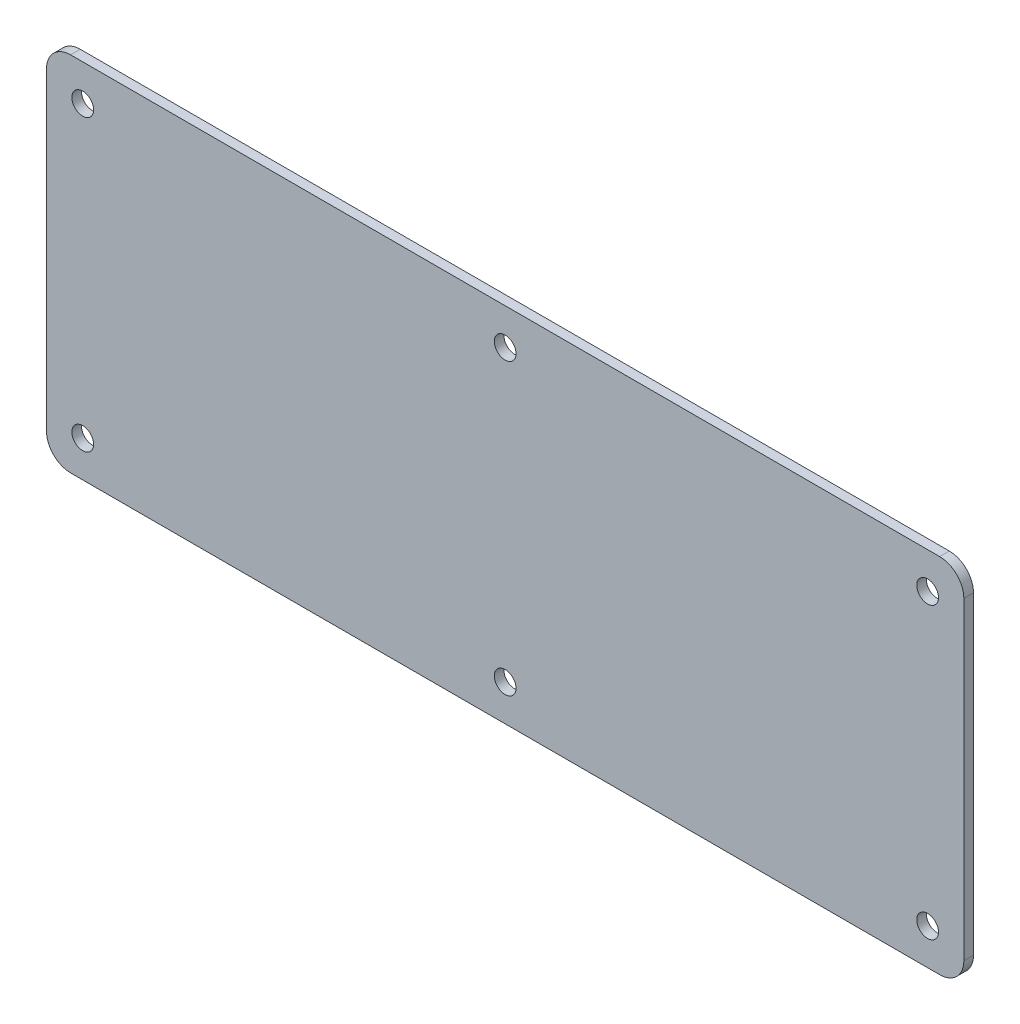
ISO-10303-21;
HEADER;
FILE_DESCRIPTION(('STEP AP214'),'2;1');
FILE_NAME('part.step','',(''),(''),'','','');
FILE_SCHEMA(('AUTOMOTIVE_DESIGN { 1 0 10303 214 1 1 1 1 }'));
ENDSEC;
DATA;
#1=APPLICATION_CONTEXT('core data for automotive mechanical design processes');
#2=APPLICATION_PROTOCOL_DEFINITION('international standard','automotive_design',2000,#1);
#3=PRODUCT_CONTEXT('',#1,'mechanical');
#4=PRODUCT('Part','Part','',(#3));
#5=PRODUCT_RELATED_PRODUCT_CATEGORY('part','',(#4));
#6=PRODUCT_DEFINITION_FORMATION('','',#4);
#7=PRODUCT_DEFINITION_CONTEXT('part definition',#1,'design');
#8=PRODUCT_DEFINITION('design','',#6,#7);
#9=PRODUCT_DEFINITION_SHAPE('','',#8);
#10=(LENGTH_UNIT() NAMED_UNIT(*) SI_UNIT(.MILLI.,.METRE.));
#11=(NAMED_UNIT(*) PLANE_ANGLE_UNIT() SI_UNIT($,.RADIAN.));
#12=(NAMED_UNIT(*) SI_UNIT($,.STERADIAN.) SOLID_ANGLE_UNIT());
#13=UNCERTAINTY_MEASURE_WITH_UNIT(LENGTH_MEASURE(1.E-05),#10,'distance_accuracy_value','');
#14=(GEOMETRIC_REPRESENTATION_CONTEXT(3) GLOBAL_UNCERTAINTY_ASSIGNED_CONTEXT((#13)) GLOBAL_UNIT_ASSIGNED_CONTEXT((#10,
#11,#12)) REPRESENTATION_CONTEXT('',''));
#15=CARTESIAN_POINT('',(0.,0.,0.));
#16=DIRECTION('',(0.,0.,1.));
#17=DIRECTION('',(1.,0.,0.));
#18=AXIS2_PLACEMENT_3D('',#15,#16,#17);
#19=CARTESIAN_POINT('',(359.966843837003,45.2847380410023,4.));
#20=DIRECTION('',(0.,0.,-1.));
#21=DIRECTION('',(-1.,0.,0.));
#22=AXIS2_PLACEMENT_3D('',#19,#20,#21);
#23=PLANE('',#22);
#24=CARTESIAN_POINT('',(179.966843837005,-79.7152619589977,4.));
#25=DIRECTION('',(0.,0.,1.));
#26=DIRECTION('',(1.,0.,0.));
#27=AXIS2_PLACEMENT_3D('',#24,#25,#26);
#28=CIRCLE('',#27,4.49999999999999);
#29=CARTESIAN_POINT('',(184.466843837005,-79.7152619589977,4.));
#30=VERTEX_POINT('',#29);
#31=EDGE_CURVE('E241',#30,#30,#28,.T.);
#32=ORIENTED_EDGE('',*,*,#31,.F.);
#33=EDGE_LOOP('',(#32));
#34=FACE_BOUND('',#33,.T.);
#35=CARTESIAN_POINT('',(354.966843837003,40.2847380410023,4.));
#36=DIRECTION('',(0.,0.,1.));
#37=DIRECTION('',(1.,0.,0.));
#38=AXIS2_PLACEMENT_3D('',#35,#36,#37);
#39=CIRCLE('',#38,4.50000000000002);
#40=CARTESIAN_POINT('',(359.466843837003,40.2847380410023,4.));
#41=VERTEX_POINT('',#40);
#42=EDGE_CURVE('E253',#41,#41,#39,.T.);
#43=ORIENTED_EDGE('',*,*,#42,.F.);
#44=EDGE_LOOP('',(#43));
#45=FACE_BOUND('',#44,.T.);
#46=CARTESIAN_POINT('',(4.96684383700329,40.2847380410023,4.));
#47=DIRECTION('',(0.,0.,1.));
#48=DIRECTION('',(1.,0.,0.));
#49=AXIS2_PLACEMENT_3D('',#46,#47,#48);
#50=CIRCLE('',#49,4.50000000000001);
#51=CARTESIAN_POINT('',(9.46684383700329,40.2847380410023,4.));
#52=VERTEX_POINT('',#51);
#53=EDGE_CURVE('E115',#52,#52,#50,.T.);
#54=ORIENTED_EDGE('',*,*,#53,.F.);
#55=EDGE_LOOP('',(#54));
#56=FACE_BOUND('',#55,.T.);
#57=CARTESIAN_POINT('',(359.966843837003,45.2847380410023,4.));
#58=DIRECTION('',(0.,0.,1.));
#59=DIRECTION('',(-1.,0.,0.));
#60=AXIS2_PLACEMENT_3D('',#57,#58,#59);
#61=CIRCLE('',#60,10.);
#62=CARTESIAN_POINT('',(369.966843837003,45.2847380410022,4.));
#63=VERTEX_POINT('',#62);
#64=CARTESIAN_POINT('',(359.966843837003,55.2847380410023,4.));
#65=VERTEX_POINT('',#64);
#66=EDGE_CURVE('E133',#63,#65,#61,.T.);
#67=ORIENTED_EDGE('',*,*,#66,.T.);
#68=DIRECTION('',(-1.,0.,0.));
#69=VECTOR('',#68,1.);
#70=CARTESIAN_POINT('',(-0.0331561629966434,55.2847380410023,4.));
#71=LINE('',#70,#69);
#72=CARTESIAN_POINT('',(-0.0331561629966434,55.2847380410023,4.));
#73=VERTEX_POINT('',#72);
#74=EDGE_CURVE('E110',#65,#73,#71,.T.);
#75=ORIENTED_EDGE('',*,*,#74,.T.);
#76=CARTESIAN_POINT('',(-0.0331561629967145,45.2847380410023,4.));
#77=DIRECTION('',(0.,0.,1.));
#78=DIRECTION('',(-1.,0.,0.));
#79=AXIS2_PLACEMENT_3D('',#76,#77,#78);
#80=CIRCLE('',#79,10.);
#81=CARTESIAN_POINT('',(-10.0331561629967,45.2847380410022,4.));
#82=VERTEX_POINT('',#81);
#83=EDGE_CURVE('E136',#73,#82,#80,.T.);
#84=ORIENTED_EDGE('',*,*,#83,.T.);
#85=DIRECTION('',(0.,-1.,0.));
#86=VECTOR('',#85,1.);
#87=CARTESIAN_POINT('',(-10.0331561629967,45.2847380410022,4.));
#88=LINE('',#87,#86);
#89=CARTESIAN_POINT('',(-10.0331561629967,-84.7152619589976,4.));
#90=VERTEX_POINT('',#89);
#91=EDGE_CURVE('E138',#82,#90,#88,.T.);
#92=ORIENTED_EDGE('',*,*,#91,.T.);
#93=CARTESIAN_POINT('',(-0.0331561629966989,-84.7152619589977,4.));
#94=DIRECTION('',(0.,0.,1.));
#95=DIRECTION('',(-1.,0.,0.));
#96=AXIS2_PLACEMENT_3D('',#93,#94,#95);
#97=CIRCLE('',#96,10.);
#98=CARTESIAN_POINT('',(-0.033156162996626,-94.7152619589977,4.));
#99=VERTEX_POINT('',#98);
#100=EDGE_CURVE('E140',#90,#99,#97,.T.);
#101=ORIENTED_EDGE('',*,*,#100,.T.);
#102=DIRECTION('',(1.,0.,0.));
#103=VECTOR('',#102,1.);
#104=CARTESIAN_POINT('',(-0.0331561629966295,-94.7152619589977,4.));
#105=LINE('',#104,#103);
#106=CARTESIAN_POINT('',(359.966843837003,-94.7152619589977,4.));
#107=VERTEX_POINT('',#106);
#108=EDGE_CURVE('E142',#99,#107,#105,.T.);
#109=ORIENTED_EDGE('',*,*,#108,.T.);
#110=CARTESIAN_POINT('',(359.966843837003,-84.7152619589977,4.));
#111=DIRECTION('',(0.,0.,1.));
#112=DIRECTION('',(-1.,0.,0.));
#113=AXIS2_PLACEMENT_3D('',#110,#111,#112);
#114=CIRCLE('',#113,10.);
#115=CARTESIAN_POINT('',(369.966843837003,-84.7152619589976,4.));
#116=VERTEX_POINT('',#115);
#117=EDGE_CURVE('E51',#107,#116,#114,.T.);
#118=ORIENTED_EDGE('',*,*,#117,.T.);
#119=DIRECTION('',(0.,1.,0.));
#120=VECTOR('',#119,1.);
#121=CARTESIAN_POINT('',(369.966843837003,45.2847380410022,4.));
#122=LINE('',#121,#120);
#123=EDGE_CURVE('E46',#116,#63,#122,.T.);
#124=ORIENTED_EDGE('',*,*,#123,.T.);
#125=EDGE_LOOP('',(#67,#75,#84,#92,#101,#109,#118,#124));
#126=FACE_BOUND('',#125,.T.);
#127=CARTESIAN_POINT('',(179.966843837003,40.2847380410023,4.));
#128=DIRECTION('',(0.,0.,1.));
#129=DIRECTION('',(1.,0.,0.));
#130=AXIS2_PLACEMENT_3D('',#127,#128,#129);
#131=CIRCLE('',#130,4.49999999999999);
#132=CARTESIAN_POINT('',(184.466843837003,40.2847380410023,4.));
#133=VERTEX_POINT('',#132);
#134=EDGE_CURVE('E259',#133,#133,#131,.T.);
#135=ORIENTED_EDGE('',*,*,#134,.F.);
#136=EDGE_LOOP('',(#135));
#137=FACE_BOUND('',#136,.T.);
#138=CARTESIAN_POINT('',(4.96684383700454,-79.7152619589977,4.));
#139=DIRECTION('',(0.,0.,1.));
#140=DIRECTION('',(1.,0.,0.));
#141=AXIS2_PLACEMENT_3D('',#138,#139,#140);
#142=CIRCLE('',#141,4.50000000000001);
#143=CARTESIAN_POINT('',(9.46684383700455,-79.7152619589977,4.));
#144=VERTEX_POINT('',#143);
#145=EDGE_CURVE('E247',#144,#144,#142,.T.);
#146=ORIENTED_EDGE('',*,*,#145,.F.);
#147=EDGE_LOOP('',(#146));
#148=FACE_BOUND('',#147,.T.);
#149=CARTESIAN_POINT('',(354.966843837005,-79.7152619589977,4.));
#150=DIRECTION('',(0.,0.,1.));
#151=DIRECTION('',(1.,0.,0.));
#152=AXIS2_PLACEMENT_3D('',#149,#150,#151);
#153=CIRCLE('',#152,4.50000000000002);
#154=CARTESIAN_POINT('',(359.466843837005,-79.7152619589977,4.));
#155=VERTEX_POINT('',#154);
#156=EDGE_CURVE('E230',#155,#155,#153,.T.);
#157=ORIENTED_EDGE('',*,*,#156,.F.);
#158=EDGE_LOOP('',(#157));
#159=FACE_BOUND('',#158,.T.);
#160=ADVANCED_FACE('F31',(#34,#45,#56,#126,#137,#148,#159),#23,.F.);
#161=CARTESIAN_POINT('',(359.966843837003,45.2847380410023,0.));
#162=DIRECTION('',(0.,0.,-1.));
#163=DIRECTION('',(-1.,0.,0.));
#164=AXIS2_PLACEMENT_3D('',#161,#162,#163);
#165=PLANE('',#164);
#166=CARTESIAN_POINT('',(179.966843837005,-79.7152619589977,0.));
#167=DIRECTION('',(0.,0.,1.));
#168=DIRECTION('',(1.,0.,0.));
#169=AXIS2_PLACEMENT_3D('',#166,#167,#168);
#170=CIRCLE('',#169,4.49999999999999);
#171=CARTESIAN_POINT('',(184.466843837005,-79.7152619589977,0.));
#172=VERTEX_POINT('',#171);
#173=EDGE_CURVE('E236',#172,#172,#170,.T.);
#174=ORIENTED_EDGE('',*,*,#173,.T.);
#175=EDGE_LOOP('',(#174));
#176=FACE_BOUND('',#175,.T.);
#177=CARTESIAN_POINT('',(354.966843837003,40.2847380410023,0.));
#178=DIRECTION('',(0.,0.,1.));
#179=DIRECTION('',(1.,0.,0.));
#180=AXIS2_PLACEMENT_3D('',#177,#178,#179);
#181=CIRCLE('',#180,4.50000000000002);
#182=CARTESIAN_POINT('',(359.466843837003,40.2847380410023,0.));
#183=VERTEX_POINT('',#182);
#184=EDGE_CURVE('E250',#183,#183,#181,.T.);
#185=ORIENTED_EDGE('',*,*,#184,.T.);
#186=EDGE_LOOP('',(#185));
#187=FACE_BOUND('',#186,.T.);
#188=CARTESIAN_POINT('',(4.96684383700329,40.2847380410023,0.));
#189=DIRECTION('',(0.,0.,1.));
#190=DIRECTION('',(1.,0.,0.));
#191=AXIS2_PLACEMENT_3D('',#188,#189,#190);
#192=CIRCLE('',#191,4.50000000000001);
#193=CARTESIAN_POINT('',(9.46684383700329,40.2847380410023,0.));
#194=VERTEX_POINT('',#193);
#195=EDGE_CURVE('E118',#194,#194,#192,.T.);
#196=ORIENTED_EDGE('',*,*,#195,.T.);
#197=EDGE_LOOP('',(#196));
#198=FACE_BOUND('',#197,.T.);
#199=CARTESIAN_POINT('',(359.966843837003,45.2847380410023,0.));
#200=DIRECTION('',(0.,0.,1.));
#201=DIRECTION('',(-1.,0.,0.));
#202=AXIS2_PLACEMENT_3D('',#199,#200,#201);
#203=CIRCLE('',#202,10.);
#204=CARTESIAN_POINT('',(369.966843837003,45.2847380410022,0.));
#205=VERTEX_POINT('',#204);
#206=CARTESIAN_POINT('',(359.966843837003,55.2847380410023,0.));
#207=VERTEX_POINT('',#206);
#208=EDGE_CURVE('E101',#205,#207,#203,.T.);
#209=ORIENTED_EDGE('',*,*,#208,.F.);
#210=DIRECTION('',(0.,1.,0.));
#211=VECTOR('',#210,1.);
#212=CARTESIAN_POINT('',(369.966843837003,45.2847380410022,0.));
#213=LINE('',#212,#211);
#214=CARTESIAN_POINT('',(369.966843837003,-84.7152619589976,0.));
#215=VERTEX_POINT('',#214);
#216=EDGE_CURVE('E131',#215,#205,#213,.T.);
#217=ORIENTED_EDGE('',*,*,#216,.F.);
#218=CARTESIAN_POINT('',(359.966843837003,-84.7152619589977,0.));
#219=DIRECTION('',(0.,0.,1.));
#220=DIRECTION('',(-1.,0.,0.));
#221=AXIS2_PLACEMENT_3D('',#218,#219,#220);
#222=CIRCLE('',#221,10.);
#223=CARTESIAN_POINT('',(359.966843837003,-94.7152619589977,0.));
#224=VERTEX_POINT('',#223);
#225=EDGE_CURVE('E129',#224,#215,#222,.T.);
#226=ORIENTED_EDGE('',*,*,#225,.F.);
#227=DIRECTION('',(1.,0.,0.));
#228=VECTOR('',#227,1.);
#229=CARTESIAN_POINT('',(-0.0331561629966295,-94.7152619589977,0.));
#230=LINE('',#229,#228);
#231=CARTESIAN_POINT('',(-0.033156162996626,-94.7152619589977,0.));
#232=VERTEX_POINT('',#231);
#233=EDGE_CURVE('E127',#232,#224,#230,.T.);
#234=ORIENTED_EDGE('',*,*,#233,.F.);
#235=CARTESIAN_POINT('',(-0.0331561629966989,-84.7152619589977,0.));
#236=DIRECTION('',(0.,0.,1.));
#237=DIRECTION('',(-1.,0.,0.));
#238=AXIS2_PLACEMENT_3D('',#235,#236,#237);
#239=CIRCLE('',#238,10.);
#240=CARTESIAN_POINT('',(-10.0331561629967,-84.7152619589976,0.));
#241=VERTEX_POINT('',#240);
#242=EDGE_CURVE('E125',#241,#232,#239,.T.);
#243=ORIENTED_EDGE('',*,*,#242,.F.);
#244=DIRECTION('',(0.,-1.,0.));
#245=VECTOR('',#244,1.);
#246=CARTESIAN_POINT('',(-10.0331561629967,45.2847380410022,0.));
#247=LINE('',#246,#245);
#248=CARTESIAN_POINT('',(-10.0331561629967,45.2847380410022,0.));
#249=VERTEX_POINT('',#248);
#250=EDGE_CURVE('E123',#249,#241,#247,.T.);
#251=ORIENTED_EDGE('',*,*,#250,.F.);
#252=CARTESIAN_POINT('',(-0.0331561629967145,45.2847380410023,0.));
#253=DIRECTION('',(0.,0.,1.));
#254=DIRECTION('',(-1.,0.,0.));
#255=AXIS2_PLACEMENT_3D('',#252,#253,#254);
#256=CIRCLE('',#255,10.);
#257=CARTESIAN_POINT('',(-0.0331561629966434,55.2847380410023,0.));
#258=VERTEX_POINT('',#257);
#259=EDGE_CURVE('E103',#258,#249,#256,.T.);
#260=ORIENTED_EDGE('',*,*,#259,.F.);
#261=DIRECTION('',(-1.,0.,0.));
#262=VECTOR('',#261,1.);
#263=CARTESIAN_POINT('',(-0.0331561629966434,55.2847380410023,0.));
#264=LINE('',#263,#262);
#265=EDGE_CURVE('E96',#207,#258,#264,.T.);
#266=ORIENTED_EDGE('',*,*,#265,.F.);
#267=EDGE_LOOP('',(#209,#217,#226,#234,#243,#251,#260,#266));
#268=FACE_BOUND('',#267,.T.);
#269=CARTESIAN_POINT('',(179.966843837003,40.2847380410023,0.));
#270=DIRECTION('',(0.,0.,1.));
#271=DIRECTION('',(1.,0.,0.));
#272=AXIS2_PLACEMENT_3D('',#269,#270,#271);
#273=CIRCLE('',#272,4.49999999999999);
#274=CARTESIAN_POINT('',(184.466843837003,40.2847380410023,0.));
#275=VERTEX_POINT('',#274);
#276=EDGE_CURVE('E256',#275,#275,#273,.T.);
#277=ORIENTED_EDGE('',*,*,#276,.T.);
#278=EDGE_LOOP('',(#277));
#279=FACE_BOUND('',#278,.T.);
#280=CARTESIAN_POINT('',(4.96684383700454,-79.7152619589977,0.));
#281=DIRECTION('',(0.,0.,1.));
#282=DIRECTION('',(1.,0.,0.));
#283=AXIS2_PLACEMENT_3D('',#280,#281,#282);
#284=CIRCLE('',#283,4.50000000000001);
#285=CARTESIAN_POINT('',(9.46684383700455,-79.7152619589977,0.));
#286=VERTEX_POINT('',#285);
#287=EDGE_CURVE('E244',#286,#286,#284,.T.);
#288=ORIENTED_EDGE('',*,*,#287,.T.);
#289=EDGE_LOOP('',(#288));
#290=FACE_BOUND('',#289,.T.);
#291=CARTESIAN_POINT('',(354.966843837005,-79.7152619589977,0.));
#292=DIRECTION('',(0.,0.,1.));
#293=DIRECTION('',(1.,0.,0.));
#294=AXIS2_PLACEMENT_3D('',#291,#292,#293);
#295=CIRCLE('',#294,4.50000000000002);
#296=CARTESIAN_POINT('',(359.466843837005,-79.7152619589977,0.));
#297=VERTEX_POINT('',#296);
#298=EDGE_CURVE('E233',#297,#297,#295,.T.);
#299=ORIENTED_EDGE('',*,*,#298,.T.);
#300=EDGE_LOOP('',(#299));
#301=FACE_BOUND('',#300,.T.);
#302=ADVANCED_FACE('F97',(#176,#187,#198,#268,#279,#290,#301),#165,.T.);
#303=CARTESIAN_POINT('',(359.966843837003,45.2847380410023,4.));
#304=DIRECTION('',(0.,0.,-1.));
#305=DIRECTION('',(-1.,0.,0.));
#306=AXIS2_PLACEMENT_3D('',#303,#304,#305);
#307=CYLINDRICAL_SURFACE('',#306,10.);
#308=ORIENTED_EDGE('',*,*,#208,.T.);
#309=DIRECTION('',(0.,0.,-1.));
#310=VECTOR('',#309,1.);
#311=CARTESIAN_POINT('',(359.966843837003,55.2847380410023,4.));
#312=LINE('',#311,#310);
#313=EDGE_CURVE('E11',#65,#207,#312,.T.);
#314=ORIENTED_EDGE('',*,*,#313,.F.);
#315=ORIENTED_EDGE('',*,*,#66,.F.);
#316=DIRECTION('',(0.,0.,-1.));
#317=VECTOR('',#316,1.);
#318=CARTESIAN_POINT('',(369.966843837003,45.2847380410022,4.));
#319=LINE('',#318,#317);
#320=EDGE_CURVE('E114',#63,#205,#319,.T.);
#321=ORIENTED_EDGE('',*,*,#320,.T.);
#322=EDGE_LOOP('',(#308,#314,#315,#321));
#323=FACE_BOUND('',#322,.T.);
#324=ADVANCED_FACE('F33',(#323),#307,.T.);
#325=CARTESIAN_POINT('',(-0.0331561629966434,55.2847380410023,4.));
#326=DIRECTION('',(0.,-1.,0.));
#327=DIRECTION('',(0.,0.,-1.));
#328=AXIS2_PLACEMENT_3D('',#325,#326,#327);
#329=PLANE('',#328);
#330=ORIENTED_EDGE('',*,*,#265,.T.);
#331=DIRECTION('',(0.,0.,-1.));
#332=VECTOR('',#331,1.);
#333=CARTESIAN_POINT('',(-0.0331561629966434,55.2847380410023,4.));
#334=LINE('',#333,#332);
#335=EDGE_CURVE('E39',#73,#258,#334,.T.);
#336=ORIENTED_EDGE('',*,*,#335,.F.);
#337=ORIENTED_EDGE('',*,*,#74,.F.);
#338=ORIENTED_EDGE('',*,*,#313,.T.);
#339=EDGE_LOOP('',(#330,#336,#337,#338));
#340=FACE_BOUND('',#339,.T.);
#341=ADVANCED_FACE('F109',(#340),#329,.F.);
#342=CARTESIAN_POINT('',(-0.0331561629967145,45.2847380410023,4.));
#343=DIRECTION('',(0.,0.,-1.));
#344=DIRECTION('',(-1.,0.,0.));
#345=AXIS2_PLACEMENT_3D('',#342,#343,#344);
#346=CYLINDRICAL_SURFACE('',#345,10.);
#347=ORIENTED_EDGE('',*,*,#259,.T.);
#348=DIRECTION('',(0.,0.,-1.));
#349=VECTOR('',#348,1.);
#350=CARTESIAN_POINT('',(-10.0331561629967,45.2847380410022,4.));
#351=LINE('',#350,#349);
#352=EDGE_CURVE('E159',#82,#249,#351,.T.);
#353=ORIENTED_EDGE('',*,*,#352,.F.);
#354=ORIENTED_EDGE('',*,*,#83,.F.);
#355=ORIENTED_EDGE('',*,*,#335,.T.);
#356=EDGE_LOOP('',(#347,#353,#354,#355));
#357=FACE_BOUND('',#356,.T.);
#358=ADVANCED_FACE('F163',(#357),#346,.T.);
#359=CARTESIAN_POINT('',(-10.0331561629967,45.2847380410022,4.));
#360=DIRECTION('',(1.,0.,0.));
#361=DIRECTION('',(0.,1.,0.));
#362=AXIS2_PLACEMENT_3D('',#359,#360,#361);
#363=PLANE('',#362);
#364=ORIENTED_EDGE('',*,*,#250,.T.);
#365=DIRECTION('',(0.,0.,-1.));
#366=VECTOR('',#365,1.);
#367=CARTESIAN_POINT('',(-10.0331561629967,-84.7152619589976,4.));
#368=LINE('',#367,#366);
#369=EDGE_CURVE('E156',#90,#241,#368,.T.);
#370=ORIENTED_EDGE('',*,*,#369,.F.);
#371=ORIENTED_EDGE('',*,*,#91,.F.);
#372=ORIENTED_EDGE('',*,*,#352,.T.);
#373=EDGE_LOOP('',(#364,#370,#371,#372));
#374=FACE_BOUND('',#373,.T.);
#375=ADVANCED_FACE('F171',(#374),#363,.F.);
#376=CARTESIAN_POINT('',(-0.0331561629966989,-84.7152619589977,4.));
#377=DIRECTION('',(0.,0.,-1.));
#378=DIRECTION('',(-1.,0.,0.));
#379=AXIS2_PLACEMENT_3D('',#376,#377,#378);
#380=CYLINDRICAL_SURFACE('',#379,10.);
#381=ORIENTED_EDGE('',*,*,#242,.T.);
#382=DIRECTION('',(0.,0.,-1.));
#383=VECTOR('',#382,1.);
#384=CARTESIAN_POINT('',(-0.033156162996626,-94.7152619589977,4.));
#385=LINE('',#384,#383);
#386=EDGE_CURVE('E153',#99,#232,#385,.T.);
#387=ORIENTED_EDGE('',*,*,#386,.F.);
#388=ORIENTED_EDGE('',*,*,#100,.F.);
#389=ORIENTED_EDGE('',*,*,#369,.T.);
#390=EDGE_LOOP('',(#381,#387,#388,#389));
#391=FACE_BOUND('',#390,.T.);
#392=ADVANCED_FACE('F174',(#391),#380,.T.);
#393=CARTESIAN_POINT('',(-0.0331561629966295,-94.7152619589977,4.));
#394=DIRECTION('',(0.,1.,0.));
#395=DIRECTION('',(0.,0.,1.));
#396=AXIS2_PLACEMENT_3D('',#393,#394,#395);
#397=PLANE('',#396);
#398=ORIENTED_EDGE('',*,*,#233,.T.);
#399=DIRECTION('',(0.,0.,-1.));
#400=VECTOR('',#399,1.);
#401=CARTESIAN_POINT('',(359.966843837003,-94.7152619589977,4.));
#402=LINE('',#401,#400);
#403=EDGE_CURVE('E150',#107,#224,#402,.T.);
#404=ORIENTED_EDGE('',*,*,#403,.F.);
#405=ORIENTED_EDGE('',*,*,#108,.F.);
#406=ORIENTED_EDGE('',*,*,#386,.T.);
#407=EDGE_LOOP('',(#398,#404,#405,#406));
#408=FACE_BOUND('',#407,.T.);
#409=ADVANCED_FACE('F179',(#408),#397,.F.);
#410=CARTESIAN_POINT('',(359.966843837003,-84.7152619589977,4.));
#411=DIRECTION('',(0.,0.,-1.));
#412=DIRECTION('',(-1.,0.,0.));
#413=AXIS2_PLACEMENT_3D('',#410,#411,#412);
#414=CYLINDRICAL_SURFACE('',#413,10.);
#415=ORIENTED_EDGE('',*,*,#225,.T.);
#416=DIRECTION('',(0.,0.,-1.));
#417=VECTOR('',#416,1.);
#418=CARTESIAN_POINT('',(369.966843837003,-84.7152619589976,4.));
#419=LINE('',#418,#417);
#420=EDGE_CURVE('E147',#116,#215,#419,.T.);
#421=ORIENTED_EDGE('',*,*,#420,.F.);
#422=ORIENTED_EDGE('',*,*,#117,.F.);
#423=ORIENTED_EDGE('',*,*,#403,.T.);
#424=EDGE_LOOP('',(#415,#421,#422,#423));
#425=FACE_BOUND('',#424,.T.);
#426=ADVANCED_FACE('F182',(#425),#414,.T.);
#427=CARTESIAN_POINT('',(369.966843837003,45.2847380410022,4.));
#428=DIRECTION('',(-1.,0.,0.));
#429=DIRECTION('',(0.,0.,1.));
#430=AXIS2_PLACEMENT_3D('',#427,#428,#429);
#431=PLANE('',#430);
#432=ORIENTED_EDGE('',*,*,#216,.T.);
#433=ORIENTED_EDGE('',*,*,#320,.F.);
#434=ORIENTED_EDGE('',*,*,#123,.F.);
#435=ORIENTED_EDGE('',*,*,#420,.T.);
#436=EDGE_LOOP('',(#432,#433,#434,#435));
#437=FACE_BOUND('',#436,.T.);
#438=ADVANCED_FACE('F184',(#437),#431,.F.);
#439=CARTESIAN_POINT('',(4.96684383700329,40.2847380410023,4.));
#440=DIRECTION('',(0.,0.,-1.));
#441=DIRECTION('',(-1.,0.,0.));
#442=AXIS2_PLACEMENT_3D('',#439,#440,#441);
#443=CYLINDRICAL_SURFACE('',#442,4.50000000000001);
#444=ORIENTED_EDGE('',*,*,#53,.T.);
#445=EDGE_LOOP('',(#444));
#446=FACE_BOUND('',#445,.T.);
#447=ORIENTED_EDGE('',*,*,#195,.F.);
#448=EDGE_LOOP('',(#447));
#449=FACE_BOUND('',#448,.T.);
#450=ADVANCED_FACE('F186',(#446,#449),#443,.F.);
#451=CARTESIAN_POINT('',(179.966843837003,40.2847380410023,4.));
#452=DIRECTION('',(0.,0.,-1.));
#453=DIRECTION('',(-1.,0.,0.));
#454=AXIS2_PLACEMENT_3D('',#451,#452,#453);
#455=CYLINDRICAL_SURFACE('',#454,4.49999999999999);
#456=ORIENTED_EDGE('',*,*,#134,.T.);
#457=EDGE_LOOP('',(#456));
#458=FACE_BOUND('',#457,.T.);
#459=ORIENTED_EDGE('',*,*,#276,.F.);
#460=EDGE_LOOP('',(#459));
#461=FACE_BOUND('',#460,.T.);
#462=ADVANCED_FACE('F192',(#458,#461),#455,.F.);
#463=CARTESIAN_POINT('',(354.966843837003,40.2847380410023,4.));
#464=DIRECTION('',(0.,0.,-1.));
#465=DIRECTION('',(-1.,0.,0.));
#466=AXIS2_PLACEMENT_3D('',#463,#464,#465);
#467=CYLINDRICAL_SURFACE('',#466,4.50000000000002);
#468=ORIENTED_EDGE('',*,*,#42,.T.);
#469=EDGE_LOOP('',(#468));
#470=FACE_BOUND('',#469,.T.);
#471=ORIENTED_EDGE('',*,*,#184,.F.);
#472=EDGE_LOOP('',(#471));
#473=FACE_BOUND('',#472,.T.);
#474=ADVANCED_FACE('F209',(#470,#473),#467,.F.);
#475=CARTESIAN_POINT('',(4.96684383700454,-79.7152619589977,4.));
#476=DIRECTION('',(0.,0.,-1.));
#477=DIRECTION('',(-1.,0.,0.));
#478=AXIS2_PLACEMENT_3D('',#475,#476,#477);
#479=CYLINDRICAL_SURFACE('',#478,4.50000000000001);
#480=ORIENTED_EDGE('',*,*,#145,.T.);
#481=EDGE_LOOP('',(#480));
#482=FACE_BOUND('',#481,.T.);
#483=ORIENTED_EDGE('',*,*,#287,.F.);
#484=EDGE_LOOP('',(#483));
#485=FACE_BOUND('',#484,.T.);
#486=ADVANCED_FACE('F213',(#482,#485),#479,.F.);
#487=CARTESIAN_POINT('',(179.966843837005,-79.7152619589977,4.));
#488=DIRECTION('',(0.,0.,-1.));
#489=DIRECTION('',(-1.,0.,0.));
#490=AXIS2_PLACEMENT_3D('',#487,#488,#489);
#491=CYLINDRICAL_SURFACE('',#490,4.49999999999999);
#492=ORIENTED_EDGE('',*,*,#31,.T.);
#493=EDGE_LOOP('',(#492));
#494=FACE_BOUND('',#493,.T.);
#495=ORIENTED_EDGE('',*,*,#173,.F.);
#496=EDGE_LOOP('',(#495));
#497=FACE_BOUND('',#496,.T.);
#498=ADVANCED_FACE('F217',(#494,#497),#491,.F.);
#499=CARTESIAN_POINT('',(354.966843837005,-79.7152619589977,4.));
#500=DIRECTION('',(0.,0.,-1.));
#501=DIRECTION('',(-1.,0.,0.));
#502=AXIS2_PLACEMENT_3D('',#499,#500,#501);
#503=CYLINDRICAL_SURFACE('',#502,4.50000000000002);
#504=ORIENTED_EDGE('',*,*,#156,.T.);
#505=EDGE_LOOP('',(#504));
#506=FACE_BOUND('',#505,.T.);
#507=ORIENTED_EDGE('',*,*,#298,.F.);
#508=EDGE_LOOP('',(#507));
#509=FACE_BOUND('',#508,.T.);
#510=ADVANCED_FACE('F221',(#506,#509),#503,.F.);
#511=CLOSED_SHELL('',(#160,#302,#324,#341,#358,#375,#392,#409,#426,#438,#450,#462,#474,#486,
#498,#510));
#512=MANIFOLD_SOLID_BREP('B2',#511);
#513=ADVANCED_BREP_SHAPE_REPRESENTATION('',(#18,#512),#14);
#514=SHAPE_DEFINITION_REPRESENTATION(#9,#513);
ENDSEC;
END-ISO-10303-21;
